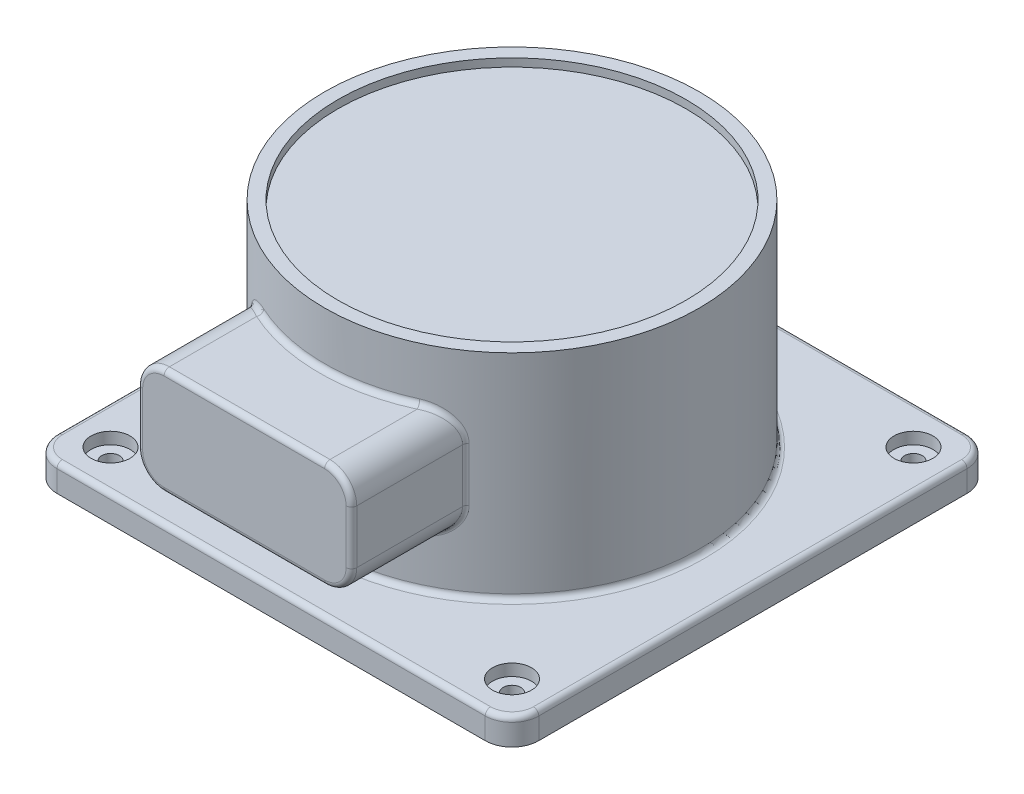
from build123d import *

# Parameters (mm, degrees)
SKETCH4_W                               = 180
SKETCH4_H                               = 180
BOSS_EXTRUDE2_DEPTH                     = 10
SKETCH5_R                               = 70
BOSS_EXTRUDE3_DEPTH                     = 80
SKETCH6_W                               = 80
SKETCH6_H                               = 40
BOSS_EXTRUDE4_DEPTH                     = 100
SKETCH7_R                               = 65
CUT_EXTRUDE1_DEPTH                      = 3
CBORE_FOR_M6_HEX_HEAD_BOLT2_D           = 6.6
CBORE_FOR_M6_HEX_HEAD_BOLT2_CBORE_D     = 14.55
CBORE_FOR_M6_HEX_HEAD_BOLT2_CBORE_DEPTH = 4.38
FILLET1_R                               = 10
FILLET2_R                               = 10
FILLET3_R                               = 2


with BuildPart() as part:
    # Sketch4 → Boss-Extrude2 (new body)
    with BuildSketch(Plane(origin=(0, 0, 0), x_dir=(1, 0, 0), z_dir=(0, 1, 0))):
        Rectangle(SKETCH4_W, SKETCH4_H)
    extrude(amount=BOSS_EXTRUDE2_DEPTH)

    # Sketch5 → Boss-Extrude3 (add)
    with BuildSketch(Plane(origin=(0, 10, 0), x_dir=(1, 0, 0), z_dir=(0, 1, 0))):
        with Locations(Location((0, 0, 0), (0, 0, 270))):
            Circle(SKETCH5_R)
    extrude(amount=BOSS_EXTRUDE3_DEPTH)

    # Sketch6 → Boss-Extrude4 (add)
    with BuildSketch(Plane.XY):
        with Locations((0, 50)):
            Rectangle(SKETCH6_W, SKETCH6_H)
    extrude(amount=BOSS_EXTRUDE4_DEPTH)

    # Sketch7 → Cut-Extrude1 (cut)
    with BuildSketch(Plane(origin=(0, 90, 0), x_dir=(1, 0, 0), z_dir=(0, 1, 0))):
        with Locations(Location((0, 0, 0), (0, 0, 270))):
            Circle(SKETCH7_R)
    extrude(amount=-CUT_EXTRUDE1_DEPTH, mode=Mode.SUBTRACT)

    # CBORE for M6 Hex Head Bolt2 (through all)
    with Locations(Plane(origin=(0, 10, 0), x_dir=(1, 0, 0), z_dir=(0, 1, 0))):
        with Locations((-75, 75), (75, 75), (75, -75), (-75, -75)):
            CounterBoreHole(CBORE_FOR_M6_HEX_HEAD_BOLT2_D / 2, CBORE_FOR_M6_HEX_HEAD_BOLT2_CBORE_D / 2, CBORE_FOR_M6_HEX_HEAD_BOLT2_CBORE_DEPTH)

    # Fillet1
    fillet1_edges = [part.edges().sort_by_distance(p)[0] for p in [
        (90, 5, 90),
        (-90, 5, 90),
        (-90, 5, -90),
        (90, 5, -90),
    ]]
    fillet(fillet1_edges, radius=FILLET1_R)

    # Fillet2
    fillet2_edges = [part.edges().sort_by_distance(p)[0] for p in [
        (-40, 70, 78.722813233),
        (40, 30, 78.722813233),
        (-40, 30, 78.722813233),
        (40, 70, 78.722813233),
    ]]
    fillet(fillet2_edges, radius=FILLET2_R)

    # Fillet3
    fillet3_edges = [part.edges().sort_by_distance(p)[0] for p in [
        (-15.375488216, 70, 68.290514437),
        (-36.872641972, 32.735924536, 59.501330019),
        (36.872641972, 32.735924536, 59.501330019),
        (-36.872641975, 67.264075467, 59.501330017),
        (36.872641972, 67.264075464, 59.501330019),
        (0, 10, -70),
        (90, 10, 0),
        (0, 10, 90),
        (0, 10, -90),
        (-90, 10, 0),
        (-87.071067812, 10, 87.071067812),
        (87.071067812, 10, -87.071067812),
        (-87.071067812, 10, -87.071067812),
        (87.071067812, 10, 87.071067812),
        (15.375488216, 30, 68.290514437),
        (0, 30, 100),
        (-40, 50, 57.445626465),
        (-40, 50, 100),
        (40, 50, 100),
        (0, 70, 100),
        (37.071067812, 67.071067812, 100),
        (-37.071067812, 67.071067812, 100),
        (37.071067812, 32.928932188, 100),
        (-37.071067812, 32.928932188, 100),
        (40, 50, 57.445626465),
    ]]
    fillet(fillet3_edges, radius=FILLET3_R)


solid = part.part
